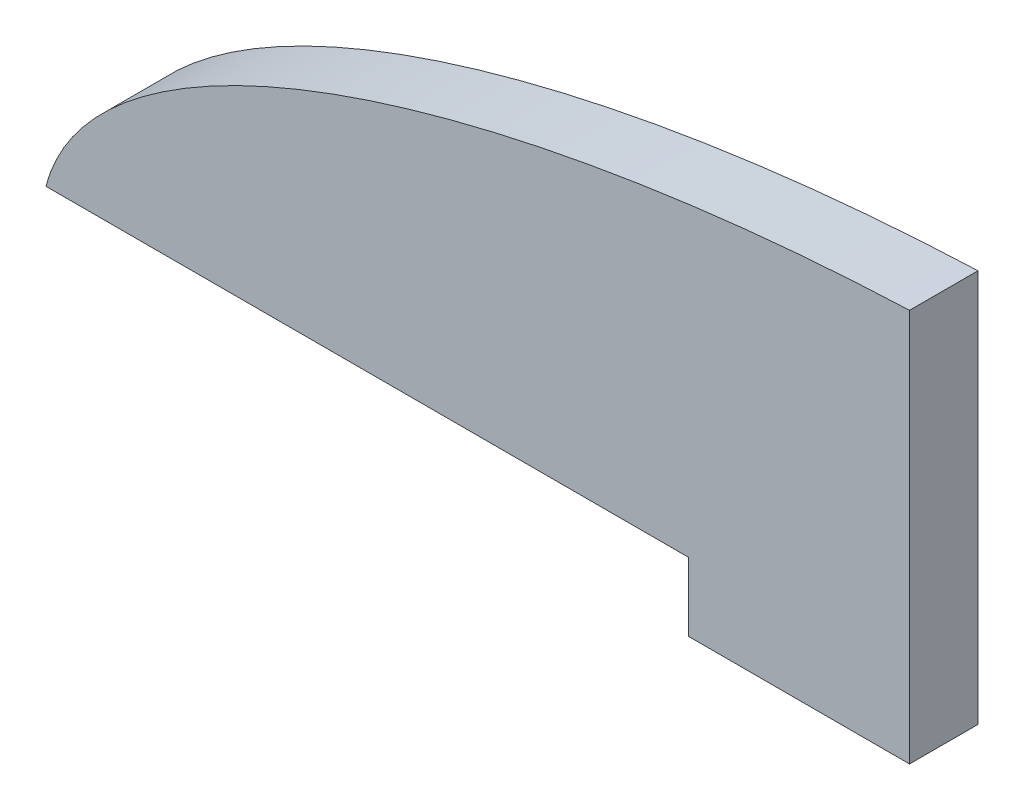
ISO-10303-21;
HEADER;
FILE_DESCRIPTION(('STEP AP214'),'2;1');
FILE_NAME('part.step','',(''),(''),'','','');
FILE_SCHEMA(('AUTOMOTIVE_DESIGN { 1 0 10303 214 1 1 1 1 }'));
ENDSEC;
DATA;
#1=APPLICATION_CONTEXT('core data for automotive mechanical design processes');
#2=APPLICATION_PROTOCOL_DEFINITION('international standard','automotive_design',2000,#1);
#3=PRODUCT_CONTEXT('',#1,'mechanical');
#4=PRODUCT('Part','Part','',(#3));
#5=PRODUCT_RELATED_PRODUCT_CATEGORY('part','',(#4));
#6=PRODUCT_DEFINITION_FORMATION('','',#4);
#7=PRODUCT_DEFINITION_CONTEXT('part definition',#1,'design');
#8=PRODUCT_DEFINITION('design','',#6,#7);
#9=PRODUCT_DEFINITION_SHAPE('','',#8);
#10=(LENGTH_UNIT() NAMED_UNIT(*) SI_UNIT(.MILLI.,.METRE.));
#11=(NAMED_UNIT(*) PLANE_ANGLE_UNIT() SI_UNIT($,.RADIAN.));
#12=(NAMED_UNIT(*) SI_UNIT($,.STERADIAN.) SOLID_ANGLE_UNIT());
#13=UNCERTAINTY_MEASURE_WITH_UNIT(LENGTH_MEASURE(1.E-05),#10,'distance_accuracy_value','');
#14=(GEOMETRIC_REPRESENTATION_CONTEXT(3) GLOBAL_UNCERTAINTY_ASSIGNED_CONTEXT((#13)) GLOBAL_UNIT_ASSIGNED_CONTEXT((#10,
#11,#12)) REPRESENTATION_CONTEXT('',''));
#15=CARTESIAN_POINT('',(0.,0.,0.));
#16=DIRECTION('',(0.,0.,1.));
#17=DIRECTION('',(1.,0.,0.));
#18=AXIS2_PLACEMENT_3D('',#15,#16,#17);
#19=CARTESIAN_POINT('',(0.,0.,3.175));
#20=DIRECTION('',(0.,0.,1.));
#21=DIRECTION('',(-1.,0.,0.));
#22=AXIS2_PLACEMENT_3D('',#19,#20,#21);
#23=ELLIPSE('',#22,45.,16.7225311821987);
#24=DIRECTION('',(0.,0.,-1.));
#25=VECTOR('',#24,1.);
#26=SURFACE_OF_LINEAR_EXTRUSION('',#23,#25);
#27=CARTESIAN_POINT('',(0.,0.,0.));
#28=DIRECTION('',(0.,0.,1.));
#29=DIRECTION('',(-1.,0.,0.));
#30=AXIS2_PLACEMENT_3D('',#27,#28,#29);
#31=ELLIPSE('',#30,45.,16.7225311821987);
#32=CARTESIAN_POINT('',(-4.7625,16.6286154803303,0.));
#33=VERTEX_POINT('',#32);
#34=CARTESIAN_POINT('',(-44.796770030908,1.58749999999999,0.));
#35=VERTEX_POINT('',#34);
#36=EDGE_CURVE('E109',#33,#35,#31,.T.);
#37=ORIENTED_EDGE('',*,*,#36,.T.);
#38=DIRECTION('',(0.,0.,-1.));
#39=VECTOR('',#38,1.);
#40=CARTESIAN_POINT('',(-44.796770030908,1.58749999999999,3.175));
#41=LINE('',#40,#39);
#42=CARTESIAN_POINT('',(-44.796770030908,1.58749999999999,3.175));
#43=VERTEX_POINT('',#42);
#44=EDGE_CURVE('E11',#43,#35,#41,.T.);
#45=ORIENTED_EDGE('',*,*,#44,.F.);
#46=CARTESIAN_POINT('',(-4.7625,16.6286154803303,3.175));
#47=VERTEX_POINT('',#46);
#48=EDGE_CURVE('E118',#47,#43,#23,.T.);
#49=ORIENTED_EDGE('',*,*,#48,.F.);
#50=DIRECTION('',(0.,0.,-1.));
#51=VECTOR('',#50,1.);
#52=CARTESIAN_POINT('',(-4.7625,16.6286154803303,3.175));
#53=LINE('',#52,#51);
#54=EDGE_CURVE('E105',#47,#33,#53,.T.);
#55=ORIENTED_EDGE('',*,*,#54,.T.);
#56=EDGE_LOOP('',(#37,#45,#49,#55));
#57=FACE_BOUND('',#56,.T.);
#58=ADVANCED_FACE('F33',(#57),#26,.F.);
#59=CARTESIAN_POINT('',(-15.,1.5875,3.175));
#60=DIRECTION('',(0.,1.,0.));
#61=DIRECTION('',(-1.,0.,0.));
#62=AXIS2_PLACEMENT_3D('',#59,#60,#61);
#63=PLANE('',#62);
#64=DIRECTION('',(1.,0.,0.));
#65=VECTOR('',#64,1.);
#66=CARTESIAN_POINT('',(-15.,1.5875,0.));
#67=LINE('',#66,#65);
#68=CARTESIAN_POINT('',(-15.,1.5875,0.));
#69=VERTEX_POINT('',#68);
#70=EDGE_CURVE('E112',#35,#69,#67,.T.);
#71=ORIENTED_EDGE('',*,*,#70,.T.);
#72=DIRECTION('',(0.,0.,-1.));
#73=VECTOR('',#72,1.);
#74=CARTESIAN_POINT('',(-15.,1.5875,3.175));
#75=LINE('',#74,#73);
#76=CARTESIAN_POINT('',(-15.,1.5875,3.175));
#77=VERTEX_POINT('',#76);
#78=EDGE_CURVE('E42',#77,#69,#75,.T.);
#79=ORIENTED_EDGE('',*,*,#78,.F.);
#80=DIRECTION('',(1.,0.,0.));
#81=VECTOR('',#80,1.);
#82=CARTESIAN_POINT('',(-15.,1.5875,3.175));
#83=LINE('',#82,#81);
#84=EDGE_CURVE('E82',#43,#77,#83,.T.);
#85=ORIENTED_EDGE('',*,*,#84,.F.);
#86=ORIENTED_EDGE('',*,*,#44,.T.);
#87=EDGE_LOOP('',(#71,#79,#85,#86));
#88=FACE_BOUND('',#87,.T.);
#89=ADVANCED_FACE('F126',(#88),#63,.F.);
#90=CARTESIAN_POINT('',(-15.,-1.5875,3.175));
#91=DIRECTION('',(1.,0.,0.));
#92=DIRECTION('',(0.,0.,-1.));
#93=AXIS2_PLACEMENT_3D('',#90,#91,#92);
#94=PLANE('',#93);
#95=DIRECTION('',(0.,-1.,0.));
#96=VECTOR('',#95,1.);
#97=CARTESIAN_POINT('',(-15.,-1.5875,0.));
#98=LINE('',#97,#96);
#99=CARTESIAN_POINT('',(-15.,-1.5875,0.));
#100=VERTEX_POINT('',#99);
#101=EDGE_CURVE('E99',#69,#100,#98,.T.);
#102=ORIENTED_EDGE('',*,*,#101,.T.);
#103=DIRECTION('',(0.,0.,-1.));
#104=VECTOR('',#103,1.);
#105=CARTESIAN_POINT('',(-15.,-1.5875,3.175));
#106=LINE('',#105,#104);
#107=CARTESIAN_POINT('',(-15.,-1.5875,3.175));
#108=VERTEX_POINT('',#107);
#109=EDGE_CURVE('E96',#108,#100,#106,.T.);
#110=ORIENTED_EDGE('',*,*,#109,.F.);
#111=DIRECTION('',(0.,-1.,0.));
#112=VECTOR('',#111,1.);
#113=CARTESIAN_POINT('',(-15.,-1.5875,3.175));
#114=LINE('',#113,#112);
#115=EDGE_CURVE('E86',#77,#108,#114,.T.);
#116=ORIENTED_EDGE('',*,*,#115,.F.);
#117=ORIENTED_EDGE('',*,*,#78,.T.);
#118=EDGE_LOOP('',(#102,#110,#116,#117));
#119=FACE_BOUND('',#118,.T.);
#120=ADVANCED_FACE('F97',(#119),#94,.F.);
#121=CARTESIAN_POINT('',(-4.7625,-1.5875,3.175));
#122=DIRECTION('',(0.,1.,0.));
#123=DIRECTION('',(-1.,0.,0.));
#124=AXIS2_PLACEMENT_3D('',#121,#122,#123);
#125=PLANE('',#124);
#126=DIRECTION('',(1.,0.,0.));
#127=VECTOR('',#126,1.);
#128=CARTESIAN_POINT('',(-4.7625,-1.5875,0.));
#129=LINE('',#128,#127);
#130=CARTESIAN_POINT('',(-4.7625,-1.5875,0.));
#131=VERTEX_POINT('',#130);
#132=EDGE_CURVE('E115',#100,#131,#129,.T.);
#133=ORIENTED_EDGE('',*,*,#132,.T.);
#134=DIRECTION('',(0.,0.,-1.));
#135=VECTOR('',#134,1.);
#136=CARTESIAN_POINT('',(-4.7625,-1.5875,3.175));
#137=LINE('',#136,#135);
#138=CARTESIAN_POINT('',(-4.7625,-1.5875,3.175));
#139=VERTEX_POINT('',#138);
#140=EDGE_CURVE('E101',#139,#131,#137,.T.);
#141=ORIENTED_EDGE('',*,*,#140,.F.);
#142=DIRECTION('',(1.,0.,0.));
#143=VECTOR('',#142,1.);
#144=CARTESIAN_POINT('',(-4.7625,-1.5875,3.175));
#145=LINE('',#144,#143);
#146=EDGE_CURVE('E90',#108,#139,#145,.T.);
#147=ORIENTED_EDGE('',*,*,#146,.F.);
#148=ORIENTED_EDGE('',*,*,#109,.T.);
#149=EDGE_LOOP('',(#133,#141,#147,#148));
#150=FACE_BOUND('',#149,.T.);
#151=ADVANCED_FACE('F103',(#150),#125,.F.);
#152=CARTESIAN_POINT('',(-4.7625,0.,3.175));
#153=DIRECTION('',(-1.,0.,0.));
#154=DIRECTION('',(0.,0.,1.));
#155=AXIS2_PLACEMENT_3D('',#152,#153,#154);
#156=PLANE('',#155);
#157=DIRECTION('',(0.,1.,0.));
#158=VECTOR('',#157,1.);
#159=CARTESIAN_POINT('',(-4.7625,0.,0.));
#160=LINE('',#159,#158);
#161=EDGE_CURVE('E70',#131,#33,#160,.T.);
#162=ORIENTED_EDGE('',*,*,#161,.T.);
#163=ORIENTED_EDGE('',*,*,#54,.F.);
#164=DIRECTION('',(0.,1.,0.));
#165=VECTOR('',#164,1.);
#166=CARTESIAN_POINT('',(-4.7625,0.,3.175));
#167=LINE('',#166,#165);
#168=EDGE_CURVE('E50',#139,#47,#167,.T.);
#169=ORIENTED_EDGE('',*,*,#168,.F.);
#170=ORIENTED_EDGE('',*,*,#140,.T.);
#171=EDGE_LOOP('',(#162,#163,#169,#170));
#172=FACE_BOUND('',#171,.T.);
#173=ADVANCED_FACE('F121',(#172),#156,.F.);
#174=CARTESIAN_POINT('',(0.,0.,3.175));
#175=DIRECTION('',(0.,0.,1.));
#176=DIRECTION('',(1.,0.,0.));
#177=AXIS2_PLACEMENT_3D('',#174,#175,#176);
#178=PLANE('',#177);
#179=ORIENTED_EDGE('',*,*,#48,.T.);
#180=ORIENTED_EDGE('',*,*,#84,.T.);
#181=ORIENTED_EDGE('',*,*,#115,.T.);
#182=ORIENTED_EDGE('',*,*,#146,.T.);
#183=ORIENTED_EDGE('',*,*,#168,.T.);
#184=EDGE_LOOP('',(#179,#180,#181,#182,#183));
#185=FACE_BOUND('',#184,.T.);
#186=ADVANCED_FACE('F88',(#185),#178,.T.);
#187=CARTESIAN_POINT('',(0.,0.,0.));
#188=DIRECTION('',(0.,0.,1.));
#189=DIRECTION('',(1.,0.,0.));
#190=AXIS2_PLACEMENT_3D('',#187,#188,#189);
#191=PLANE('',#190);
#192=ORIENTED_EDGE('',*,*,#36,.F.);
#193=ORIENTED_EDGE('',*,*,#161,.F.);
#194=ORIENTED_EDGE('',*,*,#132,.F.);
#195=ORIENTED_EDGE('',*,*,#101,.F.);
#196=ORIENTED_EDGE('',*,*,#70,.F.);
#197=EDGE_LOOP('',(#192,#193,#194,#195,#196));
#198=FACE_BOUND('',#197,.T.);
#199=ADVANCED_FACE('F120',(#198),#191,.F.);
#200=CLOSED_SHELL('',(#58,#89,#120,#151,#173,#186,#199));
#201=MANIFOLD_SOLID_BREP('B2',#200);
#202=ADVANCED_BREP_SHAPE_REPRESENTATION('',(#18,#201),#14);
#203=SHAPE_DEFINITION_REPRESENTATION(#9,#202);
ENDSEC;
END-ISO-10303-21;
